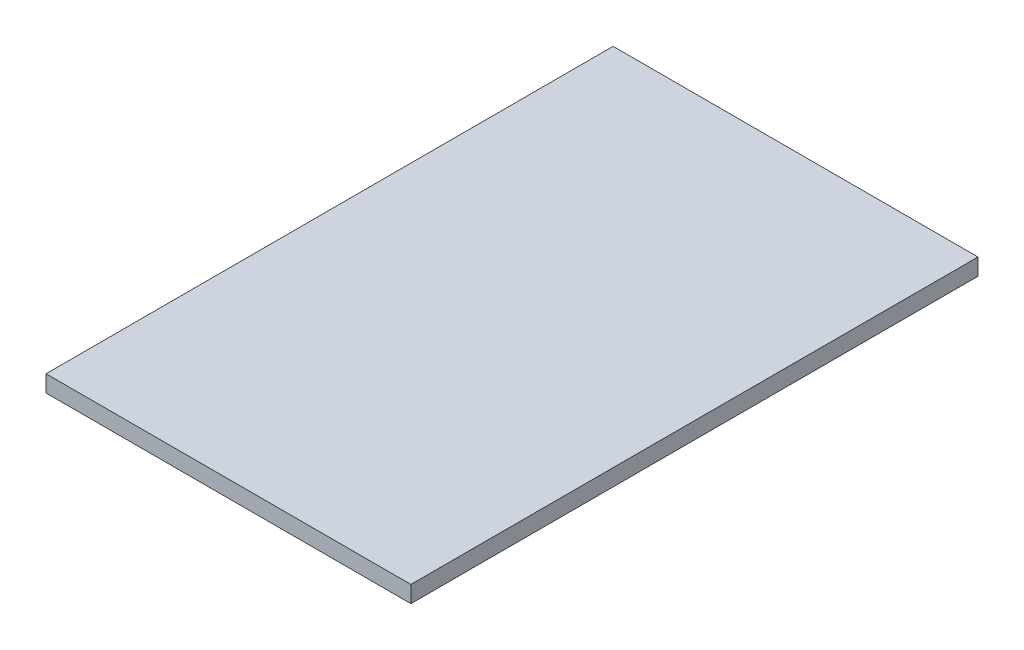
from build123d import *

# Parameters (mm, degrees)
SKETCH1_W           = 17.5
SKETCH1_H           = 27.2
BOSS_EXTRUDE1_DEPTH = 0.8


with BuildPart() as part:
    # Sketch1 → Boss-Extrude1 (new body)
    with BuildSketch(Plane(origin=(0, 0, 0), x_dir=(1, 0, 0), z_dir=(0, 1, 0))):
        with Locations((8.75, 13.6)):
            Rectangle(SKETCH1_W, SKETCH1_H)
    extrude(amount=BOSS_EXTRUDE1_DEPTH)


solid = part.part
